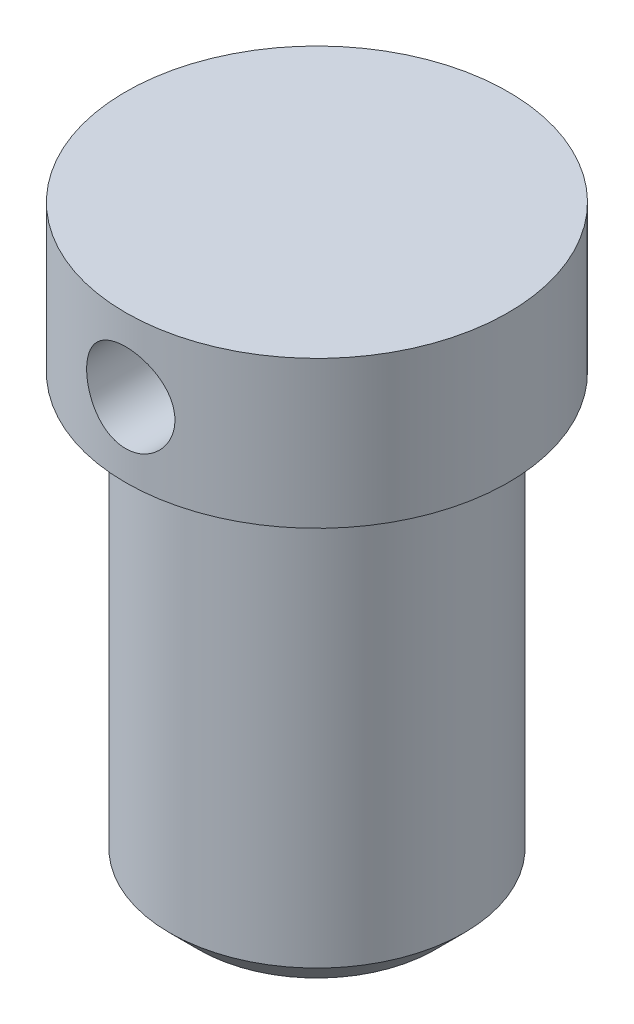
from build123d import *

# Parameters (mm, degrees)
ESQUISSE1_R                  = 5
BOSS_EXTRU_1_DEPTH           = 15
ESQUISSE2_R                  = 6.5
BOSS_EXTRU_2_DEPTH           = 5
ENL_V_MAT_EXTRU_1_DEPTH      = 10
ENL_V_MAT_EXTRU_1_DEPTH_BACK = 9
ESQUISSE3_R                  = 1.5
CHANFREIN1_SIZE              = 1


with BuildPart() as part:
    # Esquisse1 → Boss.-Extru.1 (new body)
    with BuildSketch(Plane(origin=(0, 0, 0), x_dir=(1, 0, 0), z_dir=(0, 1, 0))):
        with Locations(Location((0, 0, 0), (0, 0, 270))):
            Circle(ESQUISSE1_R)
    extrude(amount=BOSS_EXTRU_1_DEPTH)

    # Esquisse2 → Boss.-Extru.2 (add)
    with BuildSketch(Plane(origin=(0, 15, 0), x_dir=(1, 0, 0), z_dir=(0, 1, 0))):
        with Locations(Location((0, 0, 0), (0, 0, 270))):
            Circle(ESQUISSE2_R)
    extrude(amount=BOSS_EXTRU_2_DEPTH)

    # Esquisse3 → Enl_v. mat.-Extru.1 (cut, two sides: drawn at the far end of the back side and taken through both)
    with BuildSketch(Plane.XY.offset(-ENL_V_MAT_EXTRU_1_DEPTH_BACK)):
        with Locations(Location((0, 17.5, 0), (0, 0, 89.999999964))):
            Circle(ESQUISSE3_R)
    extrude(amount=ENL_V_MAT_EXTRU_1_DEPTH + ENL_V_MAT_EXTRU_1_DEPTH_BACK, mode=Mode.SUBTRACT)

    # Chanfrein1
    chanfrein1_edges = [part.edges().sort_by_distance(p)[0] for p in [
        (0, 0, -5),
    ]]
    chamfer(chanfrein1_edges, length=CHANFREIN1_SIZE)


solid = part.part
